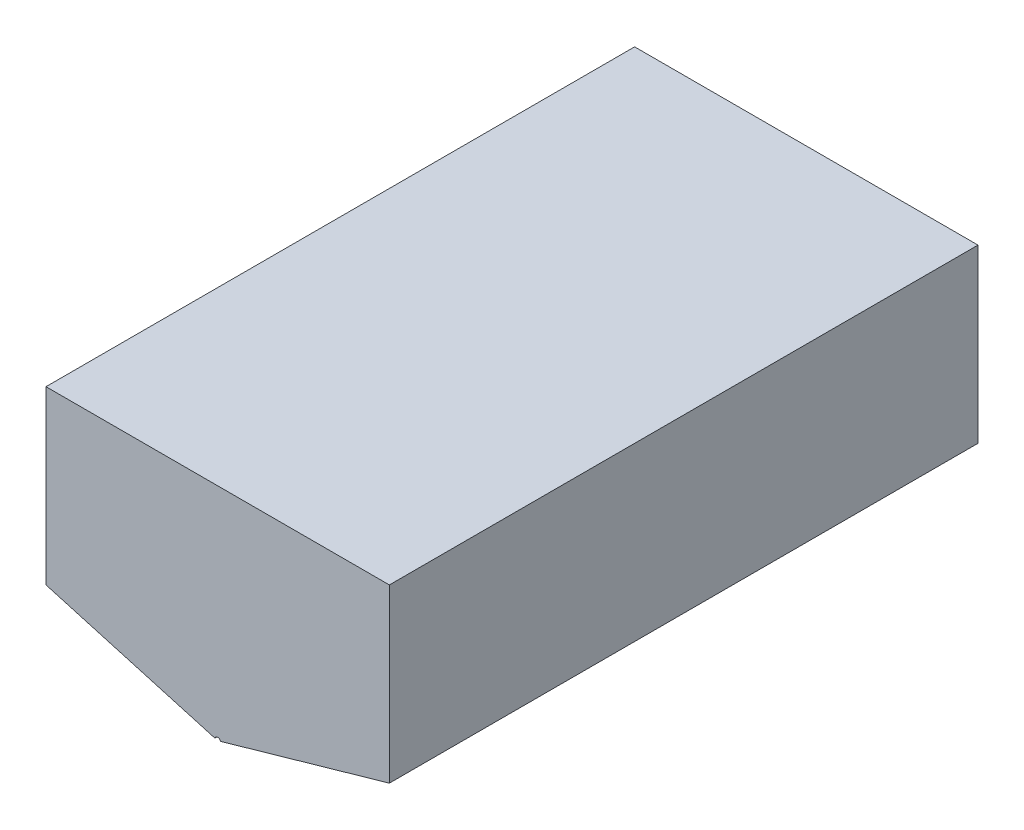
ISO-10303-21;
HEADER;
FILE_DESCRIPTION(('STEP AP214'),'2;1');
FILE_NAME('part.step','',(''),(''),'','','');
FILE_SCHEMA(('AUTOMOTIVE_DESIGN { 1 0 10303 214 1 1 1 1 }'));
ENDSEC;
DATA;
#1=APPLICATION_CONTEXT('core data for automotive mechanical design processes');
#2=APPLICATION_PROTOCOL_DEFINITION('international standard','automotive_design',2000,#1);
#3=PRODUCT_CONTEXT('',#1,'mechanical');
#4=PRODUCT('Part','Part','',(#3));
#5=PRODUCT_RELATED_PRODUCT_CATEGORY('part','',(#4));
#6=PRODUCT_DEFINITION_FORMATION('','',#4);
#7=PRODUCT_DEFINITION_CONTEXT('part definition',#1,'design');
#8=PRODUCT_DEFINITION('design','',#6,#7);
#9=PRODUCT_DEFINITION_SHAPE('','',#8);
#10=(LENGTH_UNIT() NAMED_UNIT(*) SI_UNIT(.MILLI.,.METRE.));
#11=(NAMED_UNIT(*) PLANE_ANGLE_UNIT() SI_UNIT($,.RADIAN.));
#12=(NAMED_UNIT(*) SI_UNIT($,.STERADIAN.) SOLID_ANGLE_UNIT());
#13=UNCERTAINTY_MEASURE_WITH_UNIT(LENGTH_MEASURE(1.E-05),#10,'distance_accuracy_value','');
#14=(GEOMETRIC_REPRESENTATION_CONTEXT(3) GLOBAL_UNCERTAINTY_ASSIGNED_CONTEXT((#13)) GLOBAL_UNIT_ASSIGNED_CONTEXT((#10,
#11,#12)) REPRESENTATION_CONTEXT('',''));
#15=CARTESIAN_POINT('',(0.,0.,0.));
#16=DIRECTION('',(0.,0.,1.));
#17=DIRECTION('',(1.,0.,0.));
#18=AXIS2_PLACEMENT_3D('',#15,#16,#17);
#19=CARTESIAN_POINT('',(0.,-22.5,120.));
#20=DIRECTION('',(0.,0.,-1.));
#21=DIRECTION('',(-1.,0.,0.));
#22=AXIS2_PLACEMENT_3D('',#19,#20,#21);
#23=CYLINDRICAL_SURFACE('',#22,0.400000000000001);
#24=CARTESIAN_POINT('',(0.,-22.5,90.));
#25=DIRECTION('',(0.,0.,1.));
#26=DIRECTION('',(1.,0.,0.));
#27=AXIS2_PLACEMENT_3D('',#24,#25,#26);
#28=CIRCLE('',#27,0.400000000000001);
#29=CARTESIAN_POINT('',(-0.384609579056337,-22.390111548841,90.));
#30=VERTEX_POINT('',#29);
#31=CARTESIAN_POINT('',(0.384609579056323,-22.390111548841,90.));
#32=VERTEX_POINT('',#31);
#33=EDGE_CURVE('E113',#30,#32,#28,.F.);
#34=ORIENTED_EDGE('',*,*,#33,.F.);
#35=DIRECTION('',(0.,0.,-1.));
#36=VECTOR('',#35,1.);
#37=CARTESIAN_POINT('',(-0.384609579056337,-22.390111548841,120.));
#38=LINE('',#37,#36);
#39=CARTESIAN_POINT('',(-0.384609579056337,-22.390111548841,0.));
#40=VERTEX_POINT('',#39);
#41=EDGE_CURVE('E161',#30,#40,#38,.T.);
#42=ORIENTED_EDGE('',*,*,#41,.T.);
#43=CARTESIAN_POINT('',(0.,-22.5,0.));
#44=DIRECTION('',(0.,0.,-1.));
#45=DIRECTION('',(1.,0.,0.));
#46=AXIS2_PLACEMENT_3D('',#43,#44,#45);
#47=CIRCLE('',#46,0.400000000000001);
#48=CARTESIAN_POINT('',(0.384609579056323,-22.390111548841,0.));
#49=VERTEX_POINT('',#48);
#50=EDGE_CURVE('E145',#40,#49,#47,.T.);
#51=ORIENTED_EDGE('',*,*,#50,.T.);
#52=DIRECTION('',(0.,0.,-1.));
#53=VECTOR('',#52,1.);
#54=CARTESIAN_POINT('',(0.384609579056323,-22.390111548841,120.));
#55=LINE('',#54,#53);
#56=EDGE_CURVE('E159',#32,#49,#55,.T.);
#57=ORIENTED_EDGE('',*,*,#56,.F.);
#58=EDGE_LOOP('',(#34,#42,#51,#57));
#59=FACE_BOUND('',#58,.T.);
#60=ADVANCED_FACE('F33',(#59),#23,.F.);
#61=CARTESIAN_POINT('',(-35.,-12.5,120.));
#62=DIRECTION('',(1.,0.,0.));
#63=DIRECTION('',(0.,0.,-1.));
#64=AXIS2_PLACEMENT_3D('',#61,#62,#63);
#65=PLANE('',#64);
#66=DIRECTION('',(0.,-1.,0.));
#67=VECTOR('',#66,1.);
#68=CARTESIAN_POINT('',(-35.,-12.5,0.));
#69=LINE('',#68,#67);
#70=CARTESIAN_POINT('',(-35.,22.5,0.));
#71=VERTEX_POINT('',#70);
#72=CARTESIAN_POINT('',(-35.,-12.5,0.));
#73=VERTEX_POINT('',#72);
#74=EDGE_CURVE('E131',#71,#73,#69,.T.);
#75=ORIENTED_EDGE('',*,*,#74,.T.);
#76=DIRECTION('',(0.,0.,-1.));
#77=VECTOR('',#76,1.);
#78=CARTESIAN_POINT('',(-35.,-12.5,120.));
#79=LINE('',#78,#77);
#80=CARTESIAN_POINT('',(-35.,-12.5,120.));
#81=VERTEX_POINT('',#80);
#82=EDGE_CURVE('E41',#81,#73,#79,.T.);
#83=ORIENTED_EDGE('',*,*,#82,.F.);
#84=DIRECTION('',(0.,-1.,0.));
#85=VECTOR('',#84,1.);
#86=CARTESIAN_POINT('',(-35.,-12.5,120.));
#87=LINE('',#86,#85);
#88=CARTESIAN_POINT('',(-35.,22.5,120.));
#89=VERTEX_POINT('',#88);
#90=EDGE_CURVE('E132',#89,#81,#87,.T.);
#91=ORIENTED_EDGE('',*,*,#90,.F.);
#92=DIRECTION('',(0.,0.,-1.));
#93=VECTOR('',#92,1.);
#94=CARTESIAN_POINT('',(-35.,22.5,120.));
#95=LINE('',#94,#93);
#96=EDGE_CURVE('E139',#89,#71,#95,.T.);
#97=ORIENTED_EDGE('',*,*,#96,.T.);
#98=EDGE_LOOP('',(#75,#83,#91,#97));
#99=FACE_BOUND('',#98,.T.);
#100=ADVANCED_FACE('F35',(#99),#65,.F.);
#101=CARTESIAN_POINT('',(-0.384609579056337,-22.390111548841,120.));
#102=DIRECTION('',(0.274721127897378,0.961523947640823,0.));
#103=DIRECTION('',(-0.961523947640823,0.274721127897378,0.));
#104=AXIS2_PLACEMENT_3D('',#101,#102,#103);
#105=PLANE('',#104);
#106=DIRECTION('',(0.961523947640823,-0.274721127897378,0.));
#107=VECTOR('',#106,1.);
#108=CARTESIAN_POINT('',(-0.384609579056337,-22.390111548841,90.));
#109=LINE('',#108,#107);
#110=CARTESIAN_POINT('',(-0.576914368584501,-22.3351673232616,90.));
#111=VERTEX_POINT('',#110);
#112=EDGE_CURVE('E129',#111,#30,#109,.T.);
#113=ORIENTED_EDGE('',*,*,#112,.F.);
#114=DIRECTION('',(0.,0.,1.));
#115=VECTOR('',#114,1.);
#116=CARTESIAN_POINT('',(-0.576914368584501,-22.3351673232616,90.));
#117=LINE('',#116,#115);
#118=CARTESIAN_POINT('',(-0.576914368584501,-22.3351673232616,120.));
#119=VERTEX_POINT('',#118);
#120=EDGE_CURVE('E117',#111,#119,#117,.T.);
#121=ORIENTED_EDGE('',*,*,#120,.T.);
#122=DIRECTION('',(0.961523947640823,-0.274721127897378,0.));
#123=VECTOR('',#122,1.);
#124=CARTESIAN_POINT('',(-0.384609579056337,-22.390111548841,120.));
#125=LINE('',#124,#123);
#126=EDGE_CURVE('E92',#81,#119,#125,.T.);
#127=ORIENTED_EDGE('',*,*,#126,.F.);
#128=ORIENTED_EDGE('',*,*,#82,.T.);
#129=DIRECTION('',(0.961523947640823,-0.274721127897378,0.));
#130=VECTOR('',#129,1.);
#131=CARTESIAN_POINT('',(-0.384609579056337,-22.390111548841,0.));
#132=LINE('',#131,#130);
#133=EDGE_CURVE('E142',#73,#40,#132,.T.);
#134=ORIENTED_EDGE('',*,*,#133,.T.);
#135=ORIENTED_EDGE('',*,*,#41,.F.);
#136=EDGE_LOOP('',(#113,#121,#127,#128,#134,#135));
#137=FACE_BOUND('',#136,.T.);
#138=ADVANCED_FACE('F163',(#137),#105,.F.);
#139=CARTESIAN_POINT('',(0.384609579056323,-22.390111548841,120.));
#140=DIRECTION('',(-0.274721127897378,0.961523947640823,0.));
#141=DIRECTION('',(-0.961523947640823,-0.274721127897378,0.));
#142=AXIS2_PLACEMENT_3D('',#139,#140,#141);
#143=PLANE('',#142);
#144=DIRECTION('',(0.961523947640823,0.274721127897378,0.));
#145=VECTOR('',#144,1.);
#146=CARTESIAN_POINT('',(0.384609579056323,-22.390111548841,120.));
#147=LINE('',#146,#145);
#148=CARTESIAN_POINT('',(0.576914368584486,-22.3351673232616,120.));
#149=VERTEX_POINT('',#148);
#150=CARTESIAN_POINT('',(35.,-12.5,120.));
#151=VERTEX_POINT('',#150);
#152=EDGE_CURVE('E123',#149,#151,#147,.T.);
#153=ORIENTED_EDGE('',*,*,#152,.F.);
#154=DIRECTION('',(0.,0.,1.));
#155=VECTOR('',#154,1.);
#156=CARTESIAN_POINT('',(0.576914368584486,-22.3351673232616,90.));
#157=LINE('',#156,#155);
#158=CARTESIAN_POINT('',(0.576914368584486,-22.3351673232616,90.));
#159=VERTEX_POINT('',#158);
#160=EDGE_CURVE('E48',#149,#159,#157,.F.);
#161=ORIENTED_EDGE('',*,*,#160,.T.);
#162=DIRECTION('',(0.961523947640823,0.274721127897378,0.));
#163=VECTOR('',#162,1.);
#164=CARTESIAN_POINT('',(0.384609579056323,-22.390111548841,90.));
#165=LINE('',#164,#163);
#166=EDGE_CURVE('E11',#32,#159,#165,.T.);
#167=ORIENTED_EDGE('',*,*,#166,.F.);
#168=ORIENTED_EDGE('',*,*,#56,.T.);
#169=DIRECTION('',(0.961523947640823,0.274721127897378,0.));
#170=VECTOR('',#169,1.);
#171=CARTESIAN_POINT('',(0.384609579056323,-22.390111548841,0.));
#172=LINE('',#171,#170);
#173=CARTESIAN_POINT('',(35.,-12.5,0.));
#174=VERTEX_POINT('',#173);
#175=EDGE_CURVE('E148',#49,#174,#172,.T.);
#176=ORIENTED_EDGE('',*,*,#175,.T.);
#177=DIRECTION('',(0.,0.,-1.));
#178=VECTOR('',#177,1.);
#179=CARTESIAN_POINT('',(35.,-12.5,120.));
#180=LINE('',#179,#178);
#181=EDGE_CURVE('E156',#151,#174,#180,.T.);
#182=ORIENTED_EDGE('',*,*,#181,.F.);
#183=EDGE_LOOP('',(#153,#161,#167,#168,#176,#182));
#184=FACE_BOUND('',#183,.T.);
#185=ADVANCED_FACE('F121',(#184),#143,.F.);
#186=CARTESIAN_POINT('',(35.,-12.5,120.));
#187=DIRECTION('',(-1.,0.,0.));
#188=DIRECTION('',(0.,0.,1.));
#189=AXIS2_PLACEMENT_3D('',#186,#187,#188);
#190=PLANE('',#189);
#191=DIRECTION('',(0.,1.,0.));
#192=VECTOR('',#191,1.);
#193=CARTESIAN_POINT('',(35.,-12.5,0.));
#194=LINE('',#193,#192);
#195=CARTESIAN_POINT('',(35.,22.5,0.));
#196=VERTEX_POINT('',#195);
#197=EDGE_CURVE('E150',#174,#196,#194,.T.);
#198=ORIENTED_EDGE('',*,*,#197,.T.);
#199=DIRECTION('',(0.,0.,-1.));
#200=VECTOR('',#199,1.);
#201=CARTESIAN_POINT('',(35.,22.5,120.));
#202=LINE('',#201,#200);
#203=CARTESIAN_POINT('',(35.,22.5,120.));
#204=VERTEX_POINT('',#203);
#205=EDGE_CURVE('E154',#204,#196,#202,.T.);
#206=ORIENTED_EDGE('',*,*,#205,.F.);
#207=DIRECTION('',(0.,1.,0.));
#208=VECTOR('',#207,1.);
#209=CARTESIAN_POINT('',(35.,-12.5,120.));
#210=LINE('',#209,#208);
#211=EDGE_CURVE('E136',#151,#204,#210,.T.);
#212=ORIENTED_EDGE('',*,*,#211,.F.);
#213=ORIENTED_EDGE('',*,*,#181,.T.);
#214=EDGE_LOOP('',(#198,#206,#212,#213));
#215=FACE_BOUND('',#214,.T.);
#216=ADVANCED_FACE('F178',(#215),#190,.F.);
#217=CARTESIAN_POINT('',(35.,22.5,120.));
#218=DIRECTION('',(0.,-1.,0.));
#219=DIRECTION('',(1.,0.,0.));
#220=AXIS2_PLACEMENT_3D('',#217,#218,#219);
#221=PLANE('',#220);
#222=DIRECTION('',(-1.,0.,0.));
#223=VECTOR('',#222,1.);
#224=CARTESIAN_POINT('',(35.,22.5,0.));
#225=LINE('',#224,#223);
#226=EDGE_CURVE('E84',#196,#71,#225,.T.);
#227=ORIENTED_EDGE('',*,*,#226,.T.);
#228=ORIENTED_EDGE('',*,*,#96,.F.);
#229=DIRECTION('',(-1.,0.,0.));
#230=VECTOR('',#229,1.);
#231=CARTESIAN_POINT('',(35.,22.5,120.));
#232=LINE('',#231,#230);
#233=EDGE_CURVE('E57',#204,#89,#232,.T.);
#234=ORIENTED_EDGE('',*,*,#233,.F.);
#235=ORIENTED_EDGE('',*,*,#205,.T.);
#236=EDGE_LOOP('',(#227,#228,#234,#235));
#237=FACE_BOUND('',#236,.T.);
#238=ADVANCED_FACE('F179',(#237),#221,.F.);
#239=CARTESIAN_POINT('',(0.,-22.5,120.));
#240=DIRECTION('',(0.,0.,1.));
#241=DIRECTION('',(1.,0.,0.));
#242=AXIS2_PLACEMENT_3D('',#239,#240,#241);
#243=PLANE('',#242);
#244=CARTESIAN_POINT('',(0.,-22.5,120.));
#245=DIRECTION('',(0.,0.,1.));
#246=DIRECTION('',(1.,0.,0.));
#247=AXIS2_PLACEMENT_3D('',#244,#245,#246);
#248=CIRCLE('',#247,0.6);
#249=EDGE_CURVE('E118',#149,#119,#248,.T.);
#250=ORIENTED_EDGE('',*,*,#249,.F.);
#251=ORIENTED_EDGE('',*,*,#152,.T.);
#252=ORIENTED_EDGE('',*,*,#211,.T.);
#253=ORIENTED_EDGE('',*,*,#233,.T.);
#254=ORIENTED_EDGE('',*,*,#90,.T.);
#255=ORIENTED_EDGE('',*,*,#126,.T.);
#256=EDGE_LOOP('',(#250,#251,#252,#253,#254,#255));
#257=FACE_BOUND('',#256,.T.);
#258=ADVANCED_FACE('F174',(#257),#243,.T.);
#259=CARTESIAN_POINT('',(0.,-22.5,0.));
#260=DIRECTION('',(0.,0.,1.));
#261=DIRECTION('',(1.,0.,0.));
#262=AXIS2_PLACEMENT_3D('',#259,#260,#261);
#263=PLANE('',#262);
#264=ORIENTED_EDGE('',*,*,#74,.F.);
#265=ORIENTED_EDGE('',*,*,#226,.F.);
#266=ORIENTED_EDGE('',*,*,#197,.F.);
#267=ORIENTED_EDGE('',*,*,#175,.F.);
#268=ORIENTED_EDGE('',*,*,#50,.F.);
#269=ORIENTED_EDGE('',*,*,#133,.F.);
#270=EDGE_LOOP('',(#264,#265,#266,#267,#268,#269));
#271=FACE_BOUND('',#270,.T.);
#272=ADVANCED_FACE('F170',(#271),#263,.F.);
#273=CARTESIAN_POINT('',(0.,-22.5,90.));
#274=DIRECTION('',(0.,0.,1.));
#275=DIRECTION('',(1.,0.,0.));
#276=AXIS2_PLACEMENT_3D('',#273,#274,#275);
#277=PLANE('',#276);
#278=ORIENTED_EDGE('',*,*,#112,.T.);
#279=ORIENTED_EDGE('',*,*,#33,.T.);
#280=ORIENTED_EDGE('',*,*,#166,.T.);
#281=CARTESIAN_POINT('',(0.,-22.5,90.));
#282=DIRECTION('',(0.,0.,1.));
#283=DIRECTION('',(1.,0.,0.));
#284=AXIS2_PLACEMENT_3D('',#281,#282,#283);
#285=CIRCLE('',#284,0.6);
#286=EDGE_CURVE('E110',#159,#111,#285,.T.);
#287=ORIENTED_EDGE('',*,*,#286,.T.);
#288=EDGE_LOOP('',(#278,#279,#280,#287));
#289=FACE_BOUND('',#288,.T.);
#290=ADVANCED_FACE('F109',(#289),#277,.T.);
#291=CARTESIAN_POINT('',(0.,-22.5,90.));
#292=DIRECTION('',(0.,0.,1.));
#293=DIRECTION('',(1.,0.,0.));
#294=AXIS2_PLACEMENT_3D('',#291,#292,#293);
#295=CYLINDRICAL_SURFACE('',#294,0.6);
#296=ORIENTED_EDGE('',*,*,#286,.F.);
#297=ORIENTED_EDGE('',*,*,#160,.F.);
#298=ORIENTED_EDGE('',*,*,#249,.T.);
#299=ORIENTED_EDGE('',*,*,#120,.F.);
#300=EDGE_LOOP('',(#296,#297,#298,#299));
#301=FACE_BOUND('',#300,.T.);
#302=ADVANCED_FACE('F116',(#301),#295,.F.);
#303=CLOSED_SHELL('',(#60,#100,#138,#185,#216,#238,#258,#272,#290,#302));
#304=MANIFOLD_SOLID_BREP('B2',#303);
#305=ADVANCED_BREP_SHAPE_REPRESENTATION('',(#18,#304),#14);
#306=SHAPE_DEFINITION_REPRESENTATION(#9,#305);
ENDSEC;
END-ISO-10303-21;
